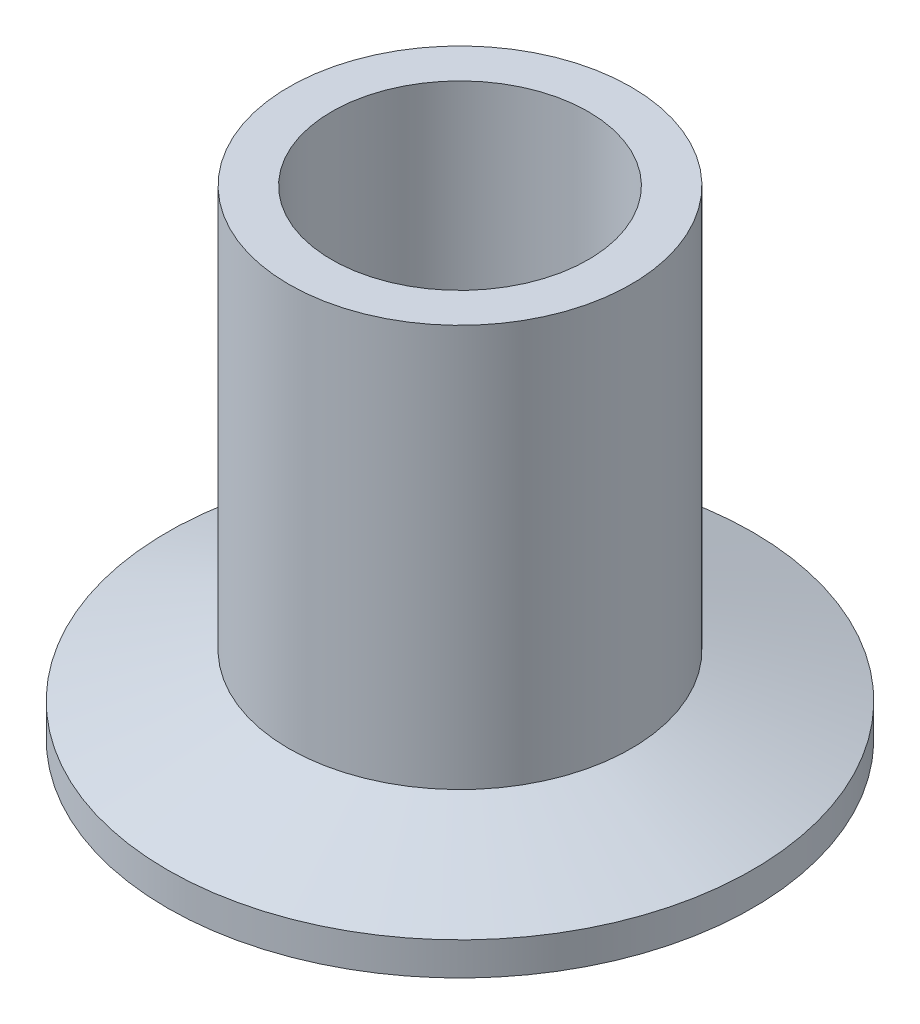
from build123d import *


with BuildPart() as part:
    # Sketch1 → Revolve2 (revolve)
    with BuildSketch(Plane.XY, mode=Mode.PRIVATE) as revolve2_sk:
        with BuildLine():
            Line((-11.049, 0), (-11.049, 41.275))
            Line((-11.049, 41.275), (-14.732, 41.275))
            Line((-14.732, 41.275), (-14.732, 6.653675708))
            Line((-14.732, 6.653675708), (-25.1968, 2.8448))
            Line((-25.1968, 2.8448), (-25.1968, 0))
            Line((-25.1968, 0), (-23.644139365, 0))
            ThreePointArc((-23.644139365, 0), (-23.374940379, 0.077191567), (-23.18755199, 0.285307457))
            Line((-23.18755199, 0.285307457), (-22.9634198, 0.744846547))
            ThreePointArc((-22.9634198, 0.744846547), (-21.855375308, 1.599633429), (-20.696794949, 0.814703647))
            Line((-20.696794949, 0.814703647), (-20.521925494, 0.334253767))
            ThreePointArc((-20.521925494, 0.334253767), (-20.335938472, 0.091870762), (-20.044561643, 0))
            Line((-20.044561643, 0), (-11.049, 0))
        make_face()
    revolve(revolve2_sk.sketch.rotate(Axis((0, 0, 0), (0, 1, 0)), 270), axis=Axis((0, 0, 0), (0, 1, 0)))


solid = part.part
